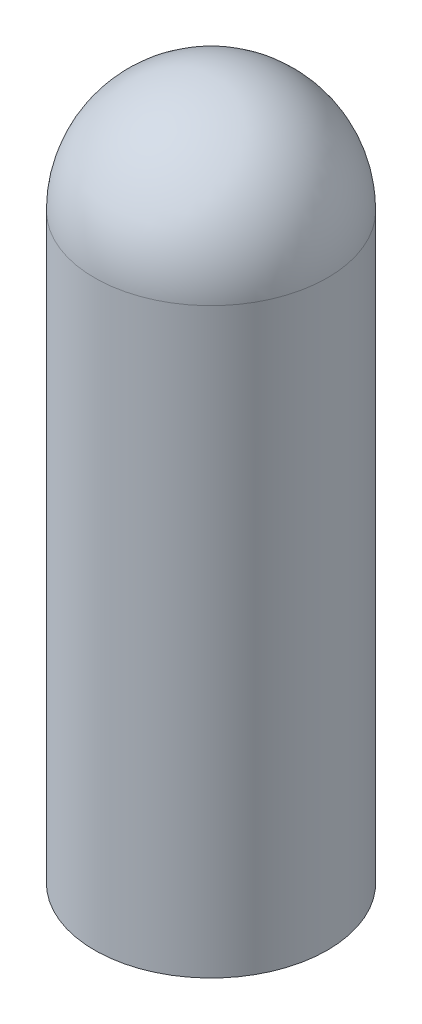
ISO-10303-21;
HEADER;
FILE_DESCRIPTION(('STEP AP214'),'2;1');
FILE_NAME('part.step','',(''),(''),'','','');
FILE_SCHEMA(('AUTOMOTIVE_DESIGN { 1 0 10303 214 1 1 1 1 }'));
ENDSEC;
DATA;
#1=APPLICATION_CONTEXT('core data for automotive mechanical design processes');
#2=APPLICATION_PROTOCOL_DEFINITION('international standard','automotive_design',2000,#1);
#3=PRODUCT_CONTEXT('',#1,'mechanical');
#4=PRODUCT('Part','Part','',(#3));
#5=PRODUCT_RELATED_PRODUCT_CATEGORY('part','',(#4));
#6=PRODUCT_DEFINITION_FORMATION('','',#4);
#7=PRODUCT_DEFINITION_CONTEXT('part definition',#1,'design');
#8=PRODUCT_DEFINITION('design','',#6,#7);
#9=PRODUCT_DEFINITION_SHAPE('','',#8);
#10=(LENGTH_UNIT() NAMED_UNIT(*) SI_UNIT(.MILLI.,.METRE.));
#11=(NAMED_UNIT(*) PLANE_ANGLE_UNIT() SI_UNIT($,.RADIAN.));
#12=(NAMED_UNIT(*) SI_UNIT($,.STERADIAN.) SOLID_ANGLE_UNIT());
#13=UNCERTAINTY_MEASURE_WITH_UNIT(LENGTH_MEASURE(1.E-05),#10,'distance_accuracy_value','');
#14=(GEOMETRIC_REPRESENTATION_CONTEXT(3) GLOBAL_UNCERTAINTY_ASSIGNED_CONTEXT((#13)) GLOBAL_UNIT_ASSIGNED_CONTEXT((#10,
#11,#12)) REPRESENTATION_CONTEXT('',''));
#15=CARTESIAN_POINT('',(0.,0.,0.));
#16=DIRECTION('',(0.,0.,1.));
#17=DIRECTION('',(1.,0.,0.));
#18=AXIS2_PLACEMENT_3D('',#15,#16,#17);
#19=CARTESIAN_POINT('',(-79.6,68.655,0.));
#20=DIRECTION('',(0.,-1.,0.));
#21=DIRECTION('',(1.,0.,0.));
#22=AXIS2_PLACEMENT_3D('',#19,#20,#21);
#23=CYLINDRICAL_SURFACE('',#22,1.4925);
#24=CARTESIAN_POINT('',(-79.6,67.1625,0.));
#25=DIRECTION('',(0.,-1.,0.));
#26=DIRECTION('',(0.,0.,-1.));
#27=AXIS2_PLACEMENT_3D('',#24,#25,#26);
#28=CIRCLE('',#27,1.4925);
#29=CARTESIAN_POINT('',(-79.6,67.1625,-1.4925));
#30=VERTEX_POINT('',#29);
#31=EDGE_CURVE('E10',#30,#30,#28,.T.);
#32=ORIENTED_EDGE('',*,*,#31,.T.);
#33=EDGE_LOOP('',(#32));
#34=FACE_BOUND('',#33,.T.);
#35=CARTESIAN_POINT('',(-79.6,59.7,0.));
#36=DIRECTION('',(0.,-1.,0.));
#37=DIRECTION('',(1.,0.,0.));
#38=AXIS2_PLACEMENT_3D('',#35,#36,#37);
#39=CIRCLE('',#38,1.4925);
#40=CARTESIAN_POINT('',(-78.1075,59.7,0.));
#41=VERTEX_POINT('',#40);
#42=EDGE_CURVE('E21',#41,#41,#39,.T.);
#43=ORIENTED_EDGE('',*,*,#42,.F.);
#44=EDGE_LOOP('',(#43));
#45=FACE_BOUND('',#44,.T.);
#46=ADVANCED_FACE('F14',(#34,#45),#23,.T.);
#47=CARTESIAN_POINT('',(-79.6,59.7,0.));
#48=DIRECTION('',(0.,-1.,0.));
#49=DIRECTION('',(1.,0.,0.));
#50=AXIS2_PLACEMENT_3D('',#47,#48,#49);
#51=PLANE('',#50);
#52=ORIENTED_EDGE('',*,*,#42,.T.);
#53=EDGE_LOOP('',(#52));
#54=FACE_BOUND('',#53,.T.);
#55=ADVANCED_FACE('F46',(#54),#51,.T.);
#56=CARTESIAN_POINT('',(-79.6,67.1625,0.));
#57=DIRECTION('',(0.,0.,1.));
#58=DIRECTION('',(1.,0.,0.));
#59=AXIS2_PLACEMENT_3D('',#56,#57,#58);
#60=SPHERICAL_SURFACE('',#59,1.4925);
#61=CARTESIAN_POINT('',(-79.6,67.1625,0.));
#62=DIRECTION('',(0.,-1.,0.));
#63=DIRECTION('',(0.,0.,-1.));
#64=AXIS2_PLACEMENT_3D('',#61,#62,#63);
#65=SPHERICAL_SURFACE('',#64,1.4925);
#66=ORIENTED_EDGE('',*,*,#31,.F.);
#67=EDGE_LOOP('',(#66));
#68=FACE_BOUND('',#67,.T.);
#69=ADVANCED_FACE('F54',(#68),#65,.T.);
#70=CLOSED_SHELL('',(#46,#55,#69));
#71=MANIFOLD_SOLID_BREP('B1',#70);
#72=ADVANCED_BREP_SHAPE_REPRESENTATION('',(#18,#71),#14);
#73=SHAPE_DEFINITION_REPRESENTATION(#9,#72);
ENDSEC;
END-ISO-10303-21;
